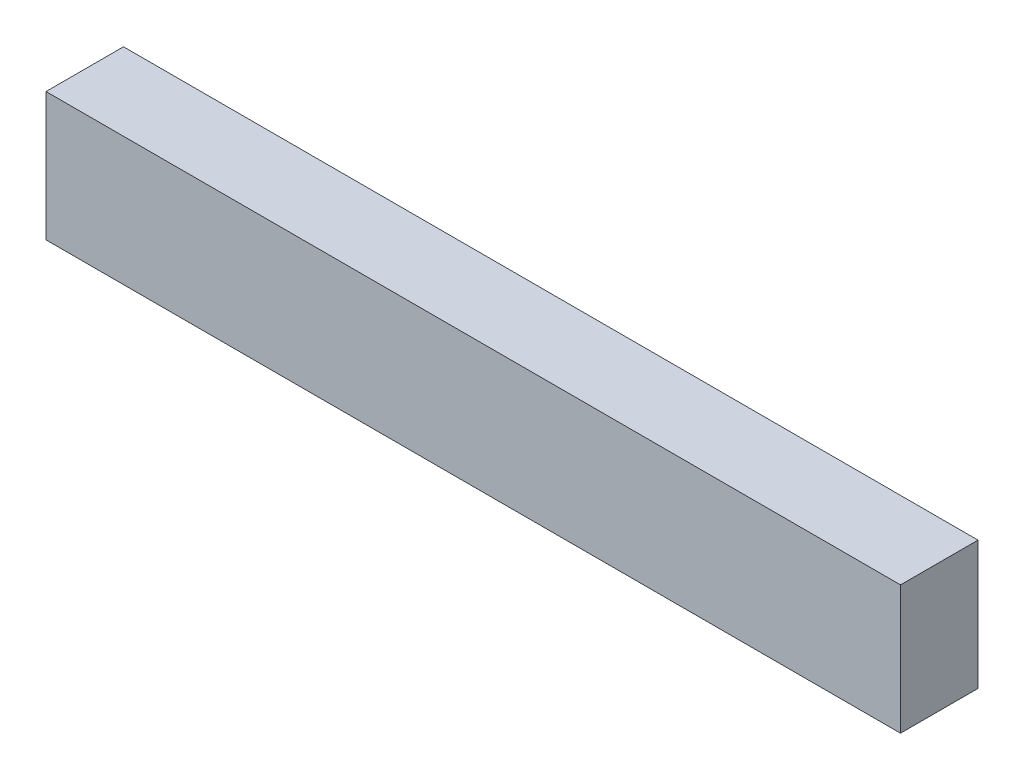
from build123d import *

# Parameters (mm, degrees)
SKETCH1_W           = 419
SKETCH1_H           = 63
BOSS_EXTRUDE1_DEPTH = 38


with BuildPart() as part:
    # Sketch1 → Boss-Extrude1 (new body)
    with BuildSketch(Plane.XY):
        with Locations((209.5, 31.5)):
            Rectangle(SKETCH1_W, SKETCH1_H)
    extrude(amount=BOSS_EXTRUDE1_DEPTH)


solid = part.part
